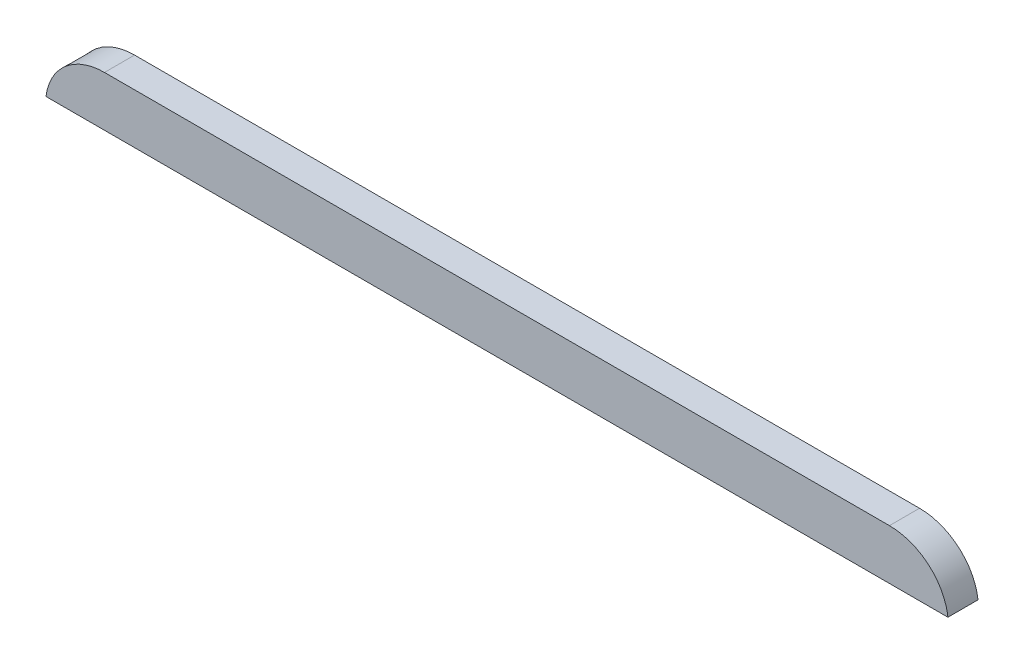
from build123d import *

# Parameters (mm, degrees)
BOSS_EXTRUDE1_DEPTH = 23


with BuildPart() as part:
    # Sketch1 → Boss-Extrude1 (new body)
    with BuildSketch(Plane.XY):
        with BuildLine():
            Line((-300, 359.463623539), (300, 359.463623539))
            add(Edge.make_bspline(
                [(300, 359.463623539), (302.68486251, 359.463623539), (305.342850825, 359.237835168), (309.288789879, 358.554318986), (310.59724812, 358.268888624), (312.5494262, 357.752447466), (313.199321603, 357.565224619), (314.483797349, 357.164831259), (315.119727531, 356.951349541), (318.268652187, 355.819226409), (320.689717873, 354.70696783), (324.168134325, 352.715953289), (325.302015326, 351.998382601), (327.516772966, 350.451605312), (328.587582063, 349.629375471), (331.688879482, 347.020064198), (333.574011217, 345.115331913), (336.128506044, 342.011861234), (336.934050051, 340.935321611), (338.450145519, 338.698670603), (339.150362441, 337.553812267), (341.078752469, 334.040203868), (342.142483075, 331.596007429), (343.38231103, 327.766486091), (343.73694127, 326.457405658), (344.313743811, 323.826814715), (344.537602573, 322.501790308), (344.698877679, 321.167332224)],
                knots=[0, 0, 0, 0, 0.125, 0.125, 0.1875, 0.1875, 0.21875, 0.21875, 0.25, 0.25, 0.375, 0.375, 0.4375, 0.4375, 0.5, 0.5, 0.625, 0.625, 0.6875, 0.6875, 0.75, 0.75, 0.875, 0.875, 0.9375, 0.9375, 1, 1, 1, 1], degree=3))
            Line((344.698877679, 321.167332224), (-344.698877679, 321.167332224))
            add(Edge.make_bspline(
                [(-344.698877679, 321.167332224), (-344.536421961, 322.511559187), (-344.310611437, 323.84496581), (-343.729022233, 326.489581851), (-343.376099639, 327.78755925), (-342.138090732, 331.605760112), (-341.073715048, 334.052731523), (-339.457336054, 336.993635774), (-339.119205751, 337.575695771), (-338.413187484, 338.727554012), (-338.045775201, 339.296449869), (-336.907731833, 340.971572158), (-336.098944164, 342.050552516), (-334.380582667, 344.132523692), (-333.469285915, 345.137867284), (-331.575374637, 347.043323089), (-330.589898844, 347.947326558), (-327.523007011, 350.519609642), (-325.333022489, 352.050560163), (-322.40585675, 353.724314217), (-321.810305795, 354.047278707), (-320.60892348, 354.664325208), (-320.002091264, 354.959016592), (-318.163441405, 355.802203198), (-316.913486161, 356.309846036), (-314.36625024, 357.218537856), (-313.081324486, 357.614903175), (-310.501647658, 358.290737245), (-309.204907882, 358.570918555), (-305.294421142, 359.241908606), (-302.660461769, 359.463623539), (-300, 359.463623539)],
                knots=[0, 0, 0, 0, 0.0625, 0.0625, 0.125, 0.125, 0.25, 0.25, 0.28125, 0.28125, 0.3125, 0.3125, 0.375, 0.375, 0.4375, 0.4375, 0.5, 0.5, 0.625, 0.625, 0.65625, 0.65625, 0.6875, 0.6875, 0.75, 0.75, 0.8125, 0.8125, 0.875, 0.875, 1, 1, 1, 1], degree=3))
        make_face()
    extrude(amount=BOSS_EXTRUDE1_DEPTH)


solid = part.part
